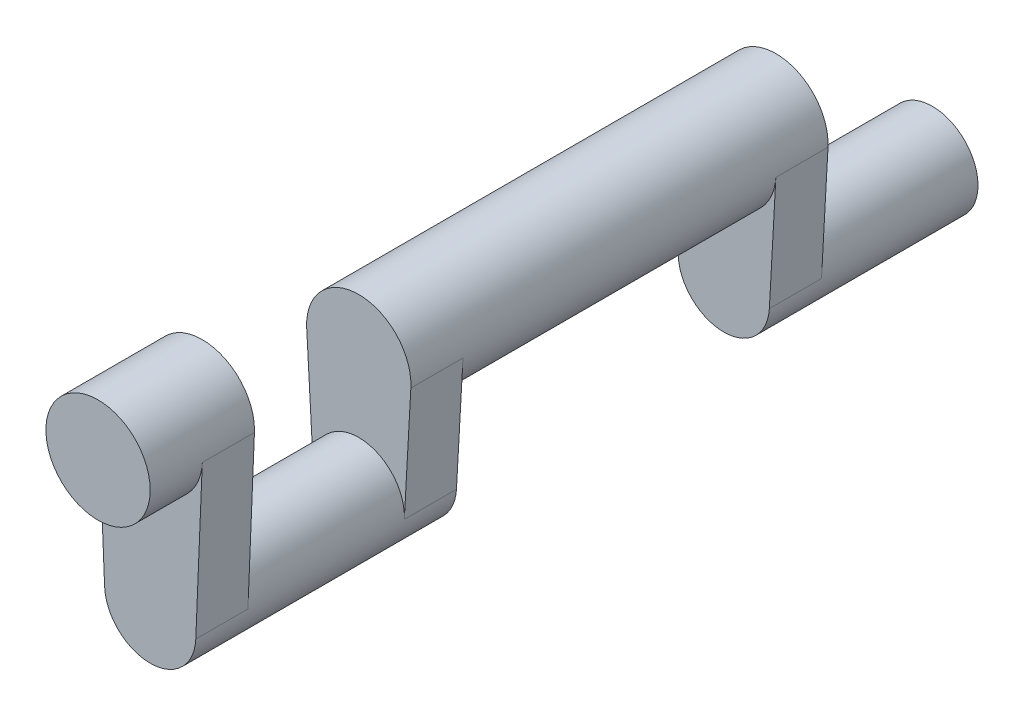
from build123d import *
from build123d.topology import SkipClean

# Parameters (mm, degrees)
SKETCH1_R             = 25.4
EXTRUDE1_DEPTH        = 25.4
LARGE_OFFSET_DEPTH    = 25.4
SKETCH3_R             = 22.225
SHORT_CYLINDER1_DEPTH = 76.2
SMALL_OFFSET1_DEPTH   = 25.4
SKETCH5_R             = 25.4
LONG_CYLINDER_DEPTH   = 203.2
SMALL_START           = -25.4
SMALL_OFFSET2_DEPTH   = 25.4
SKETCH7_R             = 22.225
SHORT_CYLINDER2_DEPTH = 76.2


with BuildPart() as part:
    # Sketch1 → Extrude1 (new body)
    with BuildSketch(Plane.XY):
        Circle(SKETCH1_R)
    extrude(amount=-EXTRUDE1_DEPTH)

    # Sketch2 → large offset (add)
    with SkipClean():  # the faces are left unmerged after this step: merging them gives an invalid solid
        with BuildSketch(Plane(origin=(0, 0, -25.4), x_dir=(-1, 0, 0), z_dir=(0, 0, -1))):
            with BuildLine():
                Line((-25.377941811, -1.058333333), (-22.205699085, -77.126041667))
                ThreePointArc((-22.205699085, -77.126041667), (0, -98.425), (22.205699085, -77.126041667))
                Line((22.205699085, -77.126041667), (25.377941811, -1.058333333))
                ThreePointArc((25.377941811, -1.058333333), (0, 25.4), (-25.377941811, -1.058333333))
            make_face()
        extrude(amount=LARGE_OFFSET_DEPTH)

    # Sketch3 → short cylinder1 (add)
    with SkipClean():  # the faces are left unmerged after this step: merging them gives an invalid solid
        with BuildSketch(Plane(origin=(0, 0, -50.8), x_dir=(-1, 0, 0), z_dir=(0, 0, -1))):
            with Locations(Location((0, -76.2, 0), (0, 0, 182.388015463))):
                Circle(SKETCH3_R)
        extrude(amount=SHORT_CYLINDER1_DEPTH)

    # Sketch4 → small offset1 (add)
    with SkipClean():  # the faces are left unmerged after this step: merging them gives an invalid solid
        with BuildSketch(Plane(origin=(0, 0, -127), x_dir=(-1, 0, 0), z_dir=(0, 0, -1))):
            with BuildLine():
                Line((-22.190675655, -77.434722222), (-25.360772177, -20.461111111))
                ThreePointArc((-25.360772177, -20.461111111), (0, 6.35), (25.360772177, -20.461111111))
                Line((25.360772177, -20.461111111), (22.190675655, -77.434722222))
                ThreePointArc((22.190675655, -77.434722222), (0, -98.425), (-22.190675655, -77.434722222))
            make_face()
        extrude(amount=SMALL_OFFSET1_DEPTH)

    # Sketch5 → long cylinder (add)
    with SkipClean():  # the faces are left unmerged after this step: merging them gives an invalid solid
        with BuildSketch(Plane(origin=(0, 0, -127), x_dir=(-1, 0, 0), z_dir=(0, 0, -1))):
            with Locations(Location((0, -19.05, 0), (0, 0, 180))):
                Circle(SKETCH5_R)
        extrude(amount=LONG_CYLINDER_DEPTH)

    # Sketch6 → small offset2 (add)
    with SkipClean():  # the faces are left unmerged after this step: merging them gives an invalid solid
        with BuildSketch(Plane(origin=(0, 0, -330.2), x_dir=(-1, 0, 0), z_dir=(0, 0, -1)).offset(SMALL_START)):
            with BuildLine():
                Line((25.360772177, -20.461111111), (22.190675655, -77.434722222))
                ThreePointArc((22.190675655, -77.434722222), (0, -98.425), (-22.190675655, -77.434722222))
                Line((-22.190675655, -77.434722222), (-25.360772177, -20.461111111))
                ThreePointArc((-25.360772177, -20.461111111), (0, 6.35), (25.360772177, -20.461111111))
            make_face()
        extrude(amount=SMALL_OFFSET2_DEPTH)

    # Sketch7 → short cylinder2 (add)
    with SkipClean():  # the faces are left unmerged after this step: merging them gives an invalid solid
        with BuildSketch(Plane.XY.offset(-330.2)):
            with Locations(Location((0, -76.2, 0), (0, 0, 357.611984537))):
                Circle(SKETCH7_R)
        extrude(amount=-SHORT_CYLINDER2_DEPTH)


solid = part.part
